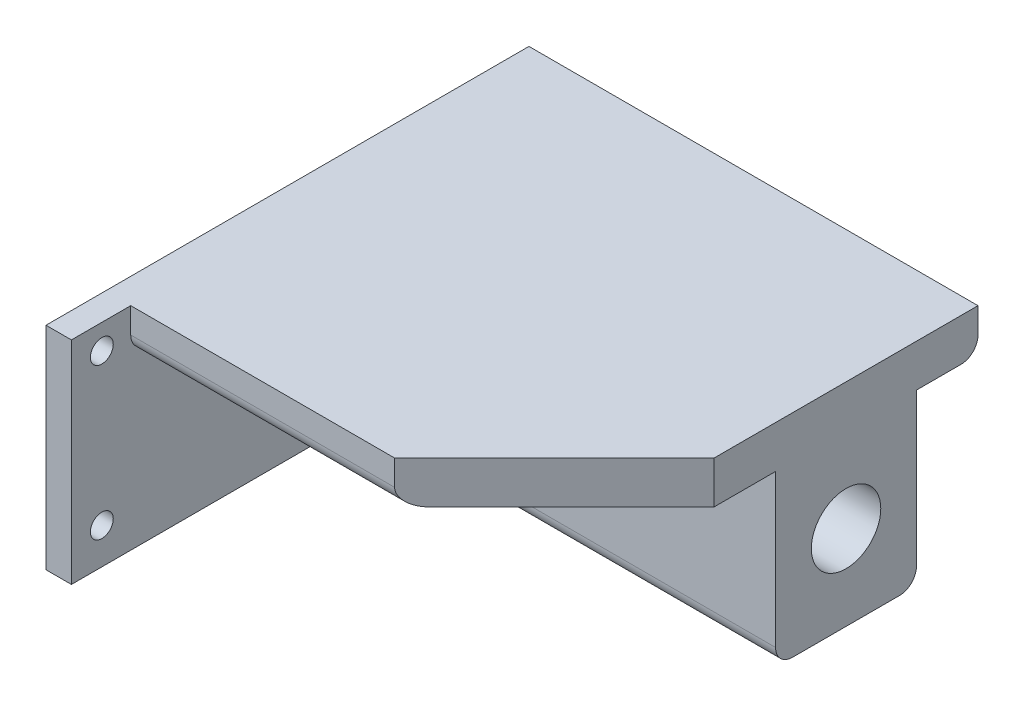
ISO-10303-21;
HEADER;
FILE_DESCRIPTION(('STEP AP214'),'2;1');
FILE_NAME('part.step','',(''),(''),'','','');
FILE_SCHEMA(('AUTOMOTIVE_DESIGN { 1 0 10303 214 1 1 1 1 }'));
ENDSEC;
DATA;
#1=APPLICATION_CONTEXT('core data for automotive mechanical design processes');
#2=APPLICATION_PROTOCOL_DEFINITION('international standard','automotive_design',2000,#1);
#3=PRODUCT_CONTEXT('',#1,'mechanical');
#4=PRODUCT('Part','Part','',(#3));
#5=PRODUCT_RELATED_PRODUCT_CATEGORY('part','',(#4));
#6=PRODUCT_DEFINITION_FORMATION('','',#4);
#7=PRODUCT_DEFINITION_CONTEXT('part definition',#1,'design');
#8=PRODUCT_DEFINITION('design','',#6,#7);
#9=PRODUCT_DEFINITION_SHAPE('','',#8);
#10=(LENGTH_UNIT() NAMED_UNIT(*) SI_UNIT(.MILLI.,.METRE.));
#11=(NAMED_UNIT(*) PLANE_ANGLE_UNIT() SI_UNIT($,.RADIAN.));
#12=(NAMED_UNIT(*) SI_UNIT($,.STERADIAN.) SOLID_ANGLE_UNIT());
#13=UNCERTAINTY_MEASURE_WITH_UNIT(LENGTH_MEASURE(1.E-05),#10,'distance_accuracy_value','');
#14=(GEOMETRIC_REPRESENTATION_CONTEXT(3) GLOBAL_UNCERTAINTY_ASSIGNED_CONTEXT((#13)) GLOBAL_UNIT_ASSIGNED_CONTEXT((#10,
#11,#12)) REPRESENTATION_CONTEXT('',''));
#15=CARTESIAN_POINT('',(0.,0.,0.));
#16=DIRECTION('',(0.,0.,1.));
#17=DIRECTION('',(1.,0.,0.));
#18=AXIS2_PLACEMENT_3D('',#15,#16,#17);
#19=CARTESIAN_POINT('',(0.,0.,0.));
#20=DIRECTION('',(0.,-1.,0.));
#21=DIRECTION('',(0.,0.,-1.));
#22=AXIS2_PLACEMENT_3D('',#19,#20,#21);
#23=PLANE('',#22);
#24=DIRECTION('',(0.,0.,1.));
#25=VECTOR('',#24,1.);
#26=CARTESIAN_POINT('',(-25.6189946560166,0.,25.6189946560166));
#27=LINE('',#26,#25);
#28=CARTESIAN_POINT('',(-25.6189946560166,0.,-22.3810053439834));
#29=VERTEX_POINT('',#28);
#30=CARTESIAN_POINT('',(-25.6189946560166,0.,-17.1193251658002));
#31=VERTEX_POINT('',#30);
#32=EDGE_CURVE('E216',#29,#31,#27,.T.);
#33=ORIENTED_EDGE('',*,*,#32,.F.);
#34=DIRECTION('',(-1.,0.,0.));
#35=VECTOR('',#34,1.);
#36=CARTESIAN_POINT('',(24.3810053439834,0.,-22.3810053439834));
#37=LINE('',#36,#35);
#38=CARTESIAN_POINT('',(24.3810053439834,0.,-22.3810053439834));
#39=VERTEX_POINT('',#38);
#40=EDGE_CURVE('E238',#29,#39,#37,.F.);
#41=ORIENTED_EDGE('',*,*,#40,.T.);
#42=DIRECTION('',(0.,0.,-1.));
#43=VECTOR('',#42,1.);
#44=CARTESIAN_POINT('',(24.3810053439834,0.,6.76758151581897));
#45=LINE('',#44,#43);
#46=CARTESIAN_POINT('',(24.3810053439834,0.,-17.1193251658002));
#47=VERTEX_POINT('',#46);
#48=EDGE_CURVE('E200',#47,#39,#45,.T.);
#49=ORIENTED_EDGE('',*,*,#48,.F.);
#50=DIRECTION('',(1.,0.,0.));
#51=VECTOR('',#50,1.);
#52=CARTESIAN_POINT('',(-25.6189946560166,0.,-17.1193251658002));
#53=LINE('',#52,#51);
#54=EDGE_CURVE('E187',#31,#47,#53,.T.);
#55=ORIENTED_EDGE('',*,*,#54,.F.);
#56=EDGE_LOOP('',(#33,#41,#49,#55));
#57=FACE_BOUND('',#56,.T.);
#58=ADVANCED_FACE('F32',(#57),#23,.T.);
#59=CARTESIAN_POINT('',(24.3810053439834,5.,6.76758151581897));
#60=DIRECTION('',(-1.,0.,0.));
#61=DIRECTION('',(0.,0.,1.));
#62=AXIS2_PLACEMENT_3D('',#59,#60,#61);
#63=PLANE('',#62);
#64=CARTESIAN_POINT('',(24.3810053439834,-10.,-8.80671191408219));
#65=DIRECTION('',(1.,0.,0.));
#66=DIRECTION('',(0.,0.,-1.));
#67=AXIS2_PLACEMENT_3D('',#64,#65,#66);
#68=CIRCLE('',#67,4.1);
#69=CARTESIAN_POINT('',(24.3810053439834,-10.,-12.9067119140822));
#70=VERTEX_POINT('',#69);
#71=EDGE_CURVE('E171',#70,#70,#68,.T.);
#72=ORIENTED_EDGE('',*,*,#71,.F.);
#73=EDGE_LOOP('',(#72));
#74=FACE_BOUND('',#73,.T.);
#75=ORIENTED_EDGE('',*,*,#48,.T.);
#76=CARTESIAN_POINT('',(24.3810053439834,2.,-22.3810053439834));
#77=DIRECTION('',(-1.,0.,0.));
#78=DIRECTION('',(0.,0.,1.));
#79=AXIS2_PLACEMENT_3D('',#76,#77,#78);
#80=CIRCLE('',#79,2.);
#81=CARTESIAN_POINT('',(24.3810053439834,2.,-24.3810053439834));
#82=VERTEX_POINT('',#81);
#83=EDGE_CURVE('E244',#39,#82,#80,.F.);
#84=ORIENTED_EDGE('',*,*,#83,.T.);
#85=DIRECTION('',(0.,-1.,0.));
#86=VECTOR('',#85,1.);
#87=CARTESIAN_POINT('',(24.3810053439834,5.,-24.3810053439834));
#88=LINE('',#87,#86);
#89=CARTESIAN_POINT('',(24.3810053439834,5.,-24.3810053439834));
#90=VERTEX_POINT('',#89);
#91=EDGE_CURVE('E226',#90,#82,#88,.T.);
#92=ORIENTED_EDGE('',*,*,#91,.F.);
#93=DIRECTION('',(0.,0.,-1.));
#94=VECTOR('',#93,1.);
#95=CARTESIAN_POINT('',(24.3810053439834,5.,6.76758151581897));
#96=LINE('',#95,#94);
#97=CARTESIAN_POINT('',(24.3810053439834,5.,6.76758151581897));
#98=VERTEX_POINT('',#97);
#99=EDGE_CURVE('E201',#98,#90,#96,.T.);
#100=ORIENTED_EDGE('',*,*,#99,.F.);
#101=DIRECTION('',(0.,-1.,0.));
#102=VECTOR('',#101,1.);
#103=CARTESIAN_POINT('',(24.3810053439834,5.,6.76758151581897));
#104=LINE('',#103,#102);
#105=CARTESIAN_POINT('',(24.3810053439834,0.,6.76758151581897));
#106=VERTEX_POINT('',#105);
#107=EDGE_CURVE('E211',#98,#106,#104,.T.);
#108=ORIENTED_EDGE('',*,*,#107,.T.);
#109=CARTESIAN_POINT('',(24.3810053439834,0.,-0.494098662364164));
#110=VERTEX_POINT('',#109);
#111=EDGE_CURVE('E212',#106,#110,#45,.T.);
#112=ORIENTED_EDGE('',*,*,#111,.T.);
#113=DIRECTION('',(0.,1.,0.));
#114=VECTOR('',#113,1.);
#115=CARTESIAN_POINT('',(24.3810053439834,-20.,-0.494098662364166));
#116=LINE('',#115,#114);
#117=CARTESIAN_POINT('',(24.3810053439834,-18.,-0.494098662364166));
#118=VERTEX_POINT('',#117);
#119=EDGE_CURVE('E198',#118,#110,#116,.T.);
#120=ORIENTED_EDGE('',*,*,#119,.F.);
#121=CARTESIAN_POINT('',(24.3810053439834,-18.,-2.49409866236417));
#122=DIRECTION('',(-1.,0.,0.));
#123=DIRECTION('',(0.,0.,1.));
#124=AXIS2_PLACEMENT_3D('',#121,#122,#123);
#125=CIRCLE('',#124,2.);
#126=CARTESIAN_POINT('',(24.3810053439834,-20.,-2.49409866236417));
#127=VERTEX_POINT('',#126);
#128=EDGE_CURVE('E240',#118,#127,#125,.F.);
#129=ORIENTED_EDGE('',*,*,#128,.T.);
#130=DIRECTION('',(0.,0.,1.));
#131=VECTOR('',#130,1.);
#132=CARTESIAN_POINT('',(24.3810053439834,-20.,-0.494098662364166));
#133=LINE('',#132,#131);
#134=CARTESIAN_POINT('',(24.3810053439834,-20.,-15.1193251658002));
#135=VERTEX_POINT('',#134);
#136=EDGE_CURVE('E183',#135,#127,#133,.T.);
#137=ORIENTED_EDGE('',*,*,#136,.F.);
#138=CARTESIAN_POINT('',(24.3810053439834,-18.,-15.1193251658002));
#139=DIRECTION('',(-1.,0.,0.));
#140=DIRECTION('',(0.,0.,1.));
#141=AXIS2_PLACEMENT_3D('',#138,#139,#140);
#142=CIRCLE('',#141,2.);
#143=CARTESIAN_POINT('',(24.3810053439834,-18.,-17.1193251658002));
#144=VERTEX_POINT('',#143);
#145=EDGE_CURVE('E242',#135,#144,#142,.F.);
#146=ORIENTED_EDGE('',*,*,#145,.T.);
#147=DIRECTION('',(0.,1.,0.));
#148=VECTOR('',#147,1.);
#149=CARTESIAN_POINT('',(24.3810053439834,-20.,-17.1193251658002));
#150=LINE('',#149,#148);
#151=EDGE_CURVE('E186',#144,#47,#150,.T.);
#152=ORIENTED_EDGE('',*,*,#151,.T.);
#153=EDGE_LOOP('',(#75,#84,#92,#100,#108,#112,#120,#129,#137,#146,#152));
#154=FACE_BOUND('',#153,.T.);
#155=ADVANCED_FACE('F339',(#74,#154),#63,.F.);
#156=CARTESIAN_POINT('',(-25.6189946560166,5.,-24.3810053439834));
#157=DIRECTION('',(0.,0.,1.));
#158=DIRECTION('',(1.,0.,0.));
#159=AXIS2_PLACEMENT_3D('',#156,#157,#158);
#160=PLANE('',#159);
#161=ORIENTED_EDGE('',*,*,#91,.T.);
#162=DIRECTION('',(-1.,0.,0.));
#163=VECTOR('',#162,1.);
#164=CARTESIAN_POINT('',(-25.6189946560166,2.,-24.3810053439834));
#165=LINE('',#164,#163);
#166=CARTESIAN_POINT('',(-25.6189946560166,2.,-24.3810053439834));
#167=VERTEX_POINT('',#166);
#168=EDGE_CURVE('E228',#82,#167,#165,.T.);
#169=ORIENTED_EDGE('',*,*,#168,.T.);
#170=DIRECTION('',(0.,-1.,0.));
#171=VECTOR('',#170,1.);
#172=CARTESIAN_POINT('',(-25.6189946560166,5.,-24.3810053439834));
#173=LINE('',#172,#171);
#174=CARTESIAN_POINT('',(-25.6189946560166,-20.,-24.3810053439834));
#175=VERTEX_POINT('',#174);
#176=EDGE_CURVE('E169',#167,#175,#173,.T.);
#177=ORIENTED_EDGE('',*,*,#176,.T.);
#178=DIRECTION('',(1.,0.,0.));
#179=VECTOR('',#178,1.);
#180=CARTESIAN_POINT('',(-28.6189946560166,-20.,-24.3810053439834));
#181=LINE('',#180,#179);
#182=CARTESIAN_POINT('',(-28.6189946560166,-20.,-24.3810053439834));
#183=VERTEX_POINT('',#182);
#184=EDGE_CURVE('E150',#183,#175,#181,.T.);
#185=ORIENTED_EDGE('',*,*,#184,.F.);
#186=DIRECTION('',(0.,-1.,0.));
#187=VECTOR('',#186,1.);
#188=CARTESIAN_POINT('',(-28.6189946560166,5.,-24.3810053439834));
#189=LINE('',#188,#187);
#190=CARTESIAN_POINT('',(-28.6189946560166,5.,-24.3810053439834));
#191=VERTEX_POINT('',#190);
#192=EDGE_CURVE('E156',#191,#183,#189,.T.);
#193=ORIENTED_EDGE('',*,*,#192,.F.);
#194=DIRECTION('',(-1.,0.,0.));
#195=VECTOR('',#194,1.);
#196=CARTESIAN_POINT('',(-25.6189946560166,5.,-24.3810053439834));
#197=LINE('',#196,#195);
#198=EDGE_CURVE('E204',#90,#191,#197,.T.);
#199=ORIENTED_EDGE('',*,*,#198,.F.);
#200=EDGE_LOOP('',(#161,#169,#177,#185,#193,#199));
#201=FACE_BOUND('',#200,.T.);
#202=ADVANCED_FACE('F167',(#201),#160,.F.);
#203=CARTESIAN_POINT('',(-25.6189946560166,5.,25.6189946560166));
#204=DIRECTION('',(0.,0.,-1.));
#205=DIRECTION('',(-1.,0.,0.));
#206=AXIS2_PLACEMENT_3D('',#203,#204,#205);
#207=PLANE('',#206);
#208=DIRECTION('',(0.,-1.,0.));
#209=VECTOR('',#208,1.);
#210=CARTESIAN_POINT('',(-25.6189946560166,5.,25.6189946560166));
#211=LINE('',#210,#209);
#212=CARTESIAN_POINT('',(-25.6189946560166,5.,25.6189946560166));
#213=VERTEX_POINT('',#212);
#214=CARTESIAN_POINT('',(-25.6189946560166,2.,25.6189946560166));
#215=VERTEX_POINT('',#214);
#216=EDGE_CURVE('E223',#213,#215,#211,.T.);
#217=ORIENTED_EDGE('',*,*,#216,.T.);
#218=DIRECTION('',(1.,0.,0.));
#219=VECTOR('',#218,1.);
#220=CARTESIAN_POINT('',(5.52959220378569,2.,25.6189946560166));
#221=LINE('',#220,#219);
#222=CARTESIAN_POINT('',(5.52959220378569,2.,25.6189946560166));
#223=VERTEX_POINT('',#222);
#224=EDGE_CURVE('E246',#215,#223,#221,.T.);
#225=ORIENTED_EDGE('',*,*,#224,.T.);
#226=DIRECTION('',(0.,-1.,0.));
#227=VECTOR('',#226,1.);
#228=CARTESIAN_POINT('',(5.52959220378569,5.,25.6189946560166));
#229=LINE('',#228,#227);
#230=CARTESIAN_POINT('',(5.52959220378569,5.,25.6189946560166));
#231=VERTEX_POINT('',#230);
#232=EDGE_CURVE('E221',#231,#223,#229,.T.);
#233=ORIENTED_EDGE('',*,*,#232,.F.);
#234=DIRECTION('',(1.,0.,0.));
#235=VECTOR('',#234,1.);
#236=CARTESIAN_POINT('',(-25.6189946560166,5.,25.6189946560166));
#237=LINE('',#236,#235);
#238=EDGE_CURVE('E207',#213,#231,#237,.T.);
#239=ORIENTED_EDGE('',*,*,#238,.F.);
#240=EDGE_LOOP('',(#217,#225,#233,#239));
#241=FACE_BOUND('',#240,.T.);
#242=ADVANCED_FACE('F371',(#241),#207,.F.);
#243=CARTESIAN_POINT('',(5.52959220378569,5.,25.6189946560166));
#244=DIRECTION('',(-0.707106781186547,0.,-0.707106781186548));
#245=DIRECTION('',(-0.707106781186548,0.,0.707106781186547));
#246=AXIS2_PLACEMENT_3D('',#243,#244,#245);
#247=PLANE('',#246);
#248=ORIENTED_EDGE('',*,*,#232,.T.);
#249=CARTESIAN_POINT('',(7.52959220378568,2.,23.6189946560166));
#250=DIRECTION('',(-0.707106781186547,0.,-0.707106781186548));
#251=DIRECTION('',(-0.707106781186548,0.,0.707106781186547));
#252=AXIS2_PLACEMENT_3D('',#249,#250,#251);
#253=ELLIPSE('',#252,2.82842712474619,2.);
#254=CARTESIAN_POINT('',(7.52959220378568,0.,23.6189946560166));
#255=VERTEX_POINT('',#254);
#256=EDGE_CURVE('E47',#223,#255,#253,.F.);
#257=ORIENTED_EDGE('',*,*,#256,.T.);
#258=DIRECTION('',(0.707106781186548,0.,-0.707106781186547));
#259=VECTOR('',#258,1.);
#260=CARTESIAN_POINT('',(5.52959220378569,0.,25.6189946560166));
#261=LINE('',#260,#259);
#262=EDGE_CURVE('E205',#255,#106,#261,.T.);
#263=ORIENTED_EDGE('',*,*,#262,.T.);
#264=ORIENTED_EDGE('',*,*,#107,.F.);
#265=DIRECTION('',(0.707106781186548,0.,-0.707106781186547));
#266=VECTOR('',#265,1.);
#267=CARTESIAN_POINT('',(5.52959220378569,5.,25.6189946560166));
#268=LINE('',#267,#266);
#269=EDGE_CURVE('E209',#231,#98,#268,.T.);
#270=ORIENTED_EDGE('',*,*,#269,.F.);
#271=EDGE_LOOP('',(#248,#257,#263,#264,#270));
#272=FACE_BOUND('',#271,.T.);
#273=ADVANCED_FACE('F361',(#272),#247,.F.);
#274=CARTESIAN_POINT('',(0.,5.,0.));
#275=DIRECTION('',(0.,-1.,0.));
#276=DIRECTION('',(0.,0.,-1.));
#277=AXIS2_PLACEMENT_3D('',#274,#275,#276);
#278=PLANE('',#277);
#279=ORIENTED_EDGE('',*,*,#99,.T.);
#280=ORIENTED_EDGE('',*,*,#198,.T.);
#281=DIRECTION('',(0.,0.,-1.));
#282=VECTOR('',#281,1.);
#283=CARTESIAN_POINT('',(-28.6189946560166,5.,-24.3810053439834));
#284=LINE('',#283,#282);
#285=CARTESIAN_POINT('',(-28.6189946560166,5.,32.6189946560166));
#286=VERTEX_POINT('',#285);
#287=EDGE_CURVE('E162',#286,#191,#284,.T.);
#288=ORIENTED_EDGE('',*,*,#287,.F.);
#289=DIRECTION('',(1.,0.,0.));
#290=VECTOR('',#289,1.);
#291=CARTESIAN_POINT('',(-28.6189946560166,5.,32.6189946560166));
#292=LINE('',#291,#290);
#293=CARTESIAN_POINT('',(-25.6189946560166,5.,32.6189946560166));
#294=VERTEX_POINT('',#293);
#295=EDGE_CURVE('E176',#286,#294,#292,.T.);
#296=ORIENTED_EDGE('',*,*,#295,.T.);
#297=DIRECTION('',(0.,0.,-1.));
#298=VECTOR('',#297,1.);
#299=CARTESIAN_POINT('',(-25.6189946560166,5.,-24.3810053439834));
#300=LINE('',#299,#298);
#301=EDGE_CURVE('E164',#294,#213,#300,.T.);
#302=ORIENTED_EDGE('',*,*,#301,.T.);
#303=ORIENTED_EDGE('',*,*,#238,.T.);
#304=ORIENTED_EDGE('',*,*,#269,.T.);
#305=EDGE_LOOP('',(#279,#280,#288,#296,#302,#303,#304));
#306=FACE_BOUND('',#305,.T.);
#307=ADVANCED_FACE('F353',(#306),#278,.F.);
#308=ORIENTED_EDGE('',*,*,#262,.F.);
#309=DIRECTION('',(1.,0.,0.));
#310=VECTOR('',#309,1.);
#311=CARTESIAN_POINT('',(-25.6189946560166,0.,23.6189946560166));
#312=LINE('',#311,#310);
#313=CARTESIAN_POINT('',(-25.6189946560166,0.,23.6189946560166));
#314=VERTEX_POINT('',#313);
#315=EDGE_CURVE('E249',#255,#314,#312,.F.);
#316=ORIENTED_EDGE('',*,*,#315,.T.);
#317=CARTESIAN_POINT('',(-25.6189946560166,0.,-0.494098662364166));
#318=VERTEX_POINT('',#317);
#319=EDGE_CURVE('E215',#318,#314,#27,.T.);
#320=ORIENTED_EDGE('',*,*,#319,.F.);
#321=DIRECTION('',(-1.,0.,0.));
#322=VECTOR('',#321,1.);
#323=CARTESIAN_POINT('',(-25.6189946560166,0.,-0.494098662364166));
#324=LINE('',#323,#322);
#325=EDGE_CURVE('E181',#110,#318,#324,.T.);
#326=ORIENTED_EDGE('',*,*,#325,.F.);
#327=ORIENTED_EDGE('',*,*,#111,.F.);
#328=EDGE_LOOP('',(#308,#316,#320,#326,#327));
#329=FACE_BOUND('',#328,.T.);
#330=ADVANCED_FACE('F342',(#329),#23,.T.);
#331=CARTESIAN_POINT('',(-25.6189946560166,-20.,-0.494098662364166));
#332=DIRECTION('',(0.,0.,-1.));
#333=DIRECTION('',(-1.,0.,0.));
#334=AXIS2_PLACEMENT_3D('',#331,#332,#333);
#335=PLANE('',#334);
#336=DIRECTION('',(0.,1.,0.));
#337=VECTOR('',#336,1.);
#338=CARTESIAN_POINT('',(-25.6189946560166,-20.,-0.494098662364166));
#339=LINE('',#338,#337);
#340=CARTESIAN_POINT('',(-25.6189946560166,-18.,-0.494098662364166));
#341=VERTEX_POINT('',#340);
#342=EDGE_CURVE('E196',#341,#318,#339,.T.);
#343=ORIENTED_EDGE('',*,*,#342,.F.);
#344=DIRECTION('',(-1.,0.,0.));
#345=VECTOR('',#344,1.);
#346=CARTESIAN_POINT('',(24.3810053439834,-18.,-0.494098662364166));
#347=LINE('',#346,#345);
#348=EDGE_CURVE('E11',#341,#118,#347,.F.);
#349=ORIENTED_EDGE('',*,*,#348,.T.);
#350=ORIENTED_EDGE('',*,*,#119,.T.);
#351=ORIENTED_EDGE('',*,*,#325,.T.);
#352=EDGE_LOOP('',(#343,#349,#350,#351));
#353=FACE_BOUND('',#352,.T.);
#354=ADVANCED_FACE('F352',(#353),#335,.F.);
#355=CARTESIAN_POINT('',(-25.6189946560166,-20.,-17.1193251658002));
#356=DIRECTION('',(0.,0.,1.));
#357=DIRECTION('',(1.,0.,0.));
#358=AXIS2_PLACEMENT_3D('',#355,#356,#357);
#359=PLANE('',#358);
#360=ORIENTED_EDGE('',*,*,#151,.F.);
#361=DIRECTION('',(1.,0.,0.));
#362=VECTOR('',#361,1.);
#363=CARTESIAN_POINT('',(-25.6189946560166,-18.,-17.1193251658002));
#364=LINE('',#363,#362);
#365=CARTESIAN_POINT('',(-25.6189946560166,-18.,-17.1193251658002));
#366=VERTEX_POINT('',#365);
#367=EDGE_CURVE('E40',#144,#366,#364,.F.);
#368=ORIENTED_EDGE('',*,*,#367,.T.);
#369=DIRECTION('',(0.,1.,0.));
#370=VECTOR('',#369,1.);
#371=CARTESIAN_POINT('',(-25.6189946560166,-20.,-17.1193251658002));
#372=LINE('',#371,#370);
#373=EDGE_CURVE('E193',#366,#31,#372,.T.);
#374=ORIENTED_EDGE('',*,*,#373,.T.);
#375=ORIENTED_EDGE('',*,*,#54,.T.);
#376=EDGE_LOOP('',(#360,#368,#374,#375));
#377=FACE_BOUND('',#376,.T.);
#378=ADVANCED_FACE('F261',(#377),#359,.F.);
#379=CARTESIAN_POINT('',(0.,-20.,0.));
#380=DIRECTION('',(0.,-1.,0.));
#381=DIRECTION('',(0.,0.,-1.));
#382=AXIS2_PLACEMENT_3D('',#379,#380,#381);
#383=PLANE('',#382);
#384=DIRECTION('',(-1.,0.,0.));
#385=VECTOR('',#384,1.);
#386=CARTESIAN_POINT('',(-25.6189946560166,-20.,-2.49409866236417));
#387=LINE('',#386,#385);
#388=CARTESIAN_POINT('',(-25.6189946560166,-20.,-2.49409866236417));
#389=VERTEX_POINT('',#388);
#390=EDGE_CURVE('E252',#127,#389,#387,.T.);
#391=ORIENTED_EDGE('',*,*,#390,.T.);
#392=DIRECTION('',(0.,0.,1.));
#393=VECTOR('',#392,1.);
#394=CARTESIAN_POINT('',(-25.6189946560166,-20.,-24.3810053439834));
#395=LINE('',#394,#393);
#396=CARTESIAN_POINT('',(-25.6189946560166,-20.,32.6189946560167));
#397=VERTEX_POINT('',#396);
#398=EDGE_CURVE('E271',#389,#397,#395,.T.);
#399=ORIENTED_EDGE('',*,*,#398,.T.);
#400=DIRECTION('',(1.,0.,0.));
#401=VECTOR('',#400,1.);
#402=CARTESIAN_POINT('',(-28.6189946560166,-20.,32.6189946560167));
#403=LINE('',#402,#401);
#404=CARTESIAN_POINT('',(-28.6189946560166,-20.,32.6189946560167));
#405=VERTEX_POINT('',#404);
#406=EDGE_CURVE('E152',#405,#397,#403,.T.);
#407=ORIENTED_EDGE('',*,*,#406,.F.);
#408=DIRECTION('',(0.,0.,1.));
#409=VECTOR('',#408,1.);
#410=CARTESIAN_POINT('',(-28.6189946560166,-20.,-24.3810053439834));
#411=LINE('',#410,#409);
#412=EDGE_CURVE('E144',#183,#405,#411,.T.);
#413=ORIENTED_EDGE('',*,*,#412,.F.);
#414=ORIENTED_EDGE('',*,*,#184,.T.);
#415=CARTESIAN_POINT('',(-25.6189946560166,-20.,-15.1193251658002));
#416=VERTEX_POINT('',#415);
#417=EDGE_CURVE('E268',#175,#416,#395,.T.);
#418=ORIENTED_EDGE('',*,*,#417,.T.);
#419=DIRECTION('',(1.,0.,0.));
#420=VECTOR('',#419,1.);
#421=CARTESIAN_POINT('',(24.3810053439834,-20.,-15.1193251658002));
#422=LINE('',#421,#420);
#423=EDGE_CURVE('E254',#416,#135,#422,.T.);
#424=ORIENTED_EDGE('',*,*,#423,.T.);
#425=ORIENTED_EDGE('',*,*,#136,.T.);
#426=EDGE_LOOP('',(#391,#399,#407,#413,#414,#418,#424,#425));
#427=FACE_BOUND('',#426,.T.);
#428=ADVANCED_FACE('F147',(#427),#383,.T.);
#429=CARTESIAN_POINT('',(-5.61899465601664,-10.,-8.80671191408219));
#430=DIRECTION('',(1.,0.,0.));
#431=DIRECTION('',(0.,0.,-1.));
#432=AXIS2_PLACEMENT_3D('',#429,#430,#431);
#433=CYLINDRICAL_SURFACE('',#432,4.1);
#434=CARTESIAN_POINT('',(-5.61899465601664,-10.,-8.80671191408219));
#435=DIRECTION('',(1.,0.,0.));
#436=DIRECTION('',(0.,0.,-1.));
#437=AXIS2_PLACEMENT_3D('',#434,#435,#436);
#438=CIRCLE('',#437,4.1);
#439=CARTESIAN_POINT('',(-5.61899465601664,-10.,-12.9067119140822));
#440=VERTEX_POINT('',#439);
#441=EDGE_CURVE('E174',#440,#440,#438,.T.);
#442=ORIENTED_EDGE('',*,*,#441,.F.);
#443=EDGE_LOOP('',(#442));
#444=FACE_BOUND('',#443,.T.);
#445=ORIENTED_EDGE('',*,*,#71,.T.);
#446=EDGE_LOOP('',(#445));
#447=FACE_BOUND('',#446,.T.);
#448=ADVANCED_FACE('F483',(#444,#447),#433,.F.);
#449=CARTESIAN_POINT('',(-5.61899465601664,-10.,-8.80671191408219));
#450=DIRECTION('',(1.,0.,0.));
#451=DIRECTION('',(0.,0.,-1.));
#452=AXIS2_PLACEMENT_3D('',#449,#450,#451);
#453=PLANE('',#452);
#454=ORIENTED_EDGE('',*,*,#441,.T.);
#455=EDGE_LOOP('',(#454));
#456=FACE_BOUND('',#455,.T.);
#457=ADVANCED_FACE('F404',(#456),#453,.T.);
#458=CARTESIAN_POINT('',(-25.6189946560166,2.,-22.3810053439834));
#459=DIRECTION('',(1.,0.,0.));
#460=DIRECTION('',(0.,0.,-1.));
#461=AXIS2_PLACEMENT_3D('',#458,#459,#460);
#462=CYLINDRICAL_SURFACE('',#461,2.);
#463=ORIENTED_EDGE('',*,*,#83,.F.);
#464=ORIENTED_EDGE('',*,*,#40,.F.);
#465=CARTESIAN_POINT('',(-25.6189946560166,2.,-22.3810053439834));
#466=DIRECTION('',(1.,0.,0.));
#467=DIRECTION('',(0.,0.,-1.));
#468=AXIS2_PLACEMENT_3D('',#465,#466,#467);
#469=CIRCLE('',#468,2.);
#470=EDGE_CURVE('E236',#167,#29,#469,.F.);
#471=ORIENTED_EDGE('',*,*,#470,.F.);
#472=ORIENTED_EDGE('',*,*,#168,.F.);
#473=EDGE_LOOP('',(#463,#464,#471,#472));
#474=FACE_BOUND('',#473,.T.);
#475=ADVANCED_FACE('F384',(#474),#462,.T.);
#476=CARTESIAN_POINT('',(-25.6189946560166,2.,23.6189946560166));
#477=DIRECTION('',(-1.,0.,0.));
#478=DIRECTION('',(0.,0.,1.));
#479=AXIS2_PLACEMENT_3D('',#476,#477,#478);
#480=CYLINDRICAL_SURFACE('',#479,2.);
#481=CARTESIAN_POINT('',(-25.6189946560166,2.,23.6189946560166));
#482=DIRECTION('',(1.,0.,0.));
#483=DIRECTION('',(0.,0.,-1.));
#484=AXIS2_PLACEMENT_3D('',#481,#482,#483);
#485=CIRCLE('',#484,2.);
#486=EDGE_CURVE('E234',#314,#215,#485,.F.);
#487=ORIENTED_EDGE('',*,*,#486,.F.);
#488=ORIENTED_EDGE('',*,*,#315,.F.);
#489=ORIENTED_EDGE('',*,*,#256,.F.);
#490=ORIENTED_EDGE('',*,*,#224,.F.);
#491=EDGE_LOOP('',(#487,#488,#489,#490));
#492=FACE_BOUND('',#491,.T.);
#493=ADVANCED_FACE('F367',(#492),#480,.T.);
#494=CARTESIAN_POINT('',(0.,-18.,-15.1193251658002));
#495=DIRECTION('',(-1.,0.,0.));
#496=DIRECTION('',(0.,0.,1.));
#497=AXIS2_PLACEMENT_3D('',#494,#495,#496);
#498=CYLINDRICAL_SURFACE('',#497,2.);
#499=CARTESIAN_POINT('',(-25.6189946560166,-18.,-15.1193251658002));
#500=DIRECTION('',(1.,0.,0.));
#501=DIRECTION('',(0.,0.,-1.));
#502=AXIS2_PLACEMENT_3D('',#499,#500,#501);
#503=CIRCLE('',#502,2.);
#504=EDGE_CURVE('E232',#366,#416,#503,.F.);
#505=ORIENTED_EDGE('',*,*,#504,.F.);
#506=ORIENTED_EDGE('',*,*,#367,.F.);
#507=ORIENTED_EDGE('',*,*,#145,.F.);
#508=ORIENTED_EDGE('',*,*,#423,.F.);
#509=EDGE_LOOP('',(#505,#506,#507,#508));
#510=FACE_BOUND('',#509,.T.);
#511=ADVANCED_FACE('F265',(#510),#498,.T.);
#512=CARTESIAN_POINT('',(0.,-18.,-2.49409866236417));
#513=DIRECTION('',(1.,0.,0.));
#514=DIRECTION('',(0.,0.,-1.));
#515=AXIS2_PLACEMENT_3D('',#512,#513,#514);
#516=CYLINDRICAL_SURFACE('',#515,2.);
#517=ORIENTED_EDGE('',*,*,#128,.F.);
#518=ORIENTED_EDGE('',*,*,#348,.F.);
#519=CARTESIAN_POINT('',(-25.6189946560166,-18.,-2.49409866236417));
#520=DIRECTION('',(1.,0.,0.));
#521=DIRECTION('',(0.,0.,-1.));
#522=AXIS2_PLACEMENT_3D('',#519,#520,#521);
#523=CIRCLE('',#522,2.);
#524=EDGE_CURVE('E230',#389,#341,#523,.F.);
#525=ORIENTED_EDGE('',*,*,#524,.F.);
#526=ORIENTED_EDGE('',*,*,#390,.F.);
#527=EDGE_LOOP('',(#517,#518,#525,#526));
#528=FACE_BOUND('',#527,.T.);
#529=ADVANCED_FACE('F34',(#528),#516,.T.);
#530=CARTESIAN_POINT('',(-25.6189946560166,0.,0.));
#531=DIRECTION('',(-1.,0.,0.));
#532=DIRECTION('',(0.,0.,1.));
#533=AXIS2_PLACEMENT_3D('',#530,#531,#532);
#534=PLANE('',#533);
#535=CARTESIAN_POINT('',(-25.6189946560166,-15.7498007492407,-21.1167764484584));
#536=DIRECTION('',(-1.,0.,0.));
#537=DIRECTION('',(0.,0.,1.));
#538=AXIS2_PLACEMENT_3D('',#535,#536,#537);
#539=CIRCLE('',#538,1.35);
#540=CARTESIAN_POINT('',(-25.6189946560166,-15.7498007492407,-19.7667764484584));
#541=VERTEX_POINT('',#540);
#542=EDGE_CURVE('E290',#541,#541,#539,.T.);
#543=ORIENTED_EDGE('',*,*,#542,.T.);
#544=EDGE_LOOP('',(#543));
#545=FACE_BOUND('',#544,.T.);
#546=CARTESIAN_POINT('',(-25.6189946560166,-3.149002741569,-21.1167764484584));
#547=DIRECTION('',(-1.,0.,0.));
#548=DIRECTION('',(0.,0.,1.));
#549=AXIS2_PLACEMENT_3D('',#546,#547,#548);
#550=CIRCLE('',#549,1.35);
#551=CARTESIAN_POINT('',(-25.6189946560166,-3.149002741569,-19.7667764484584));
#552=VERTEX_POINT('',#551);
#553=EDGE_CURVE('E284',#552,#552,#550,.T.);
#554=ORIENTED_EDGE('',*,*,#553,.T.);
#555=EDGE_LOOP('',(#554));
#556=FACE_BOUND('',#555,.T.);
#557=ORIENTED_EDGE('',*,*,#176,.F.);
#558=ORIENTED_EDGE('',*,*,#470,.T.);
#559=ORIENTED_EDGE('',*,*,#32,.T.);
#560=ORIENTED_EDGE('',*,*,#373,.F.);
#561=ORIENTED_EDGE('',*,*,#504,.T.);
#562=ORIENTED_EDGE('',*,*,#417,.F.);
#563=EDGE_LOOP('',(#557,#558,#559,#560,#561,#562));
#564=FACE_BOUND('',#563,.T.);
#565=ADVANCED_FACE('F267',(#545,#556,#564),#534,.F.);
#566=CARTESIAN_POINT('',(-25.6189946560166,-15.7498007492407,29.0298516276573));
#567=DIRECTION('',(-1.,0.,0.));
#568=DIRECTION('',(0.,0.,1.));
#569=AXIS2_PLACEMENT_3D('',#566,#567,#568);
#570=CIRCLE('',#569,1.35);
#571=CARTESIAN_POINT('',(-25.6189946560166,-15.7498007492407,30.3798516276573));
#572=VERTEX_POINT('',#571);
#573=EDGE_CURVE('E293',#572,#572,#570,.T.);
#574=ORIENTED_EDGE('',*,*,#573,.T.);
#575=EDGE_LOOP('',(#574));
#576=FACE_BOUND('',#575,.T.);
#577=CARTESIAN_POINT('',(-25.6189946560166,2.09174198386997,29.0298516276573));
#578=DIRECTION('',(-1.,0.,0.));
#579=DIRECTION('',(0.,0.,1.));
#580=AXIS2_PLACEMENT_3D('',#577,#578,#579);
#581=CIRCLE('',#580,1.35);
#582=CARTESIAN_POINT('',(-25.6189946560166,2.09174198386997,30.3798516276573));
#583=VERTEX_POINT('',#582);
#584=EDGE_CURVE('E296',#583,#583,#581,.T.);
#585=ORIENTED_EDGE('',*,*,#584,.T.);
#586=EDGE_LOOP('',(#585));
#587=FACE_BOUND('',#586,.T.);
#588=ORIENTED_EDGE('',*,*,#398,.F.);
#589=ORIENTED_EDGE('',*,*,#524,.T.);
#590=ORIENTED_EDGE('',*,*,#342,.T.);
#591=ORIENTED_EDGE('',*,*,#319,.T.);
#592=ORIENTED_EDGE('',*,*,#486,.T.);
#593=ORIENTED_EDGE('',*,*,#216,.F.);
#594=ORIENTED_EDGE('',*,*,#301,.F.);
#595=DIRECTION('',(0.,1.,0.));
#596=VECTOR('',#595,1.);
#597=CARTESIAN_POINT('',(-25.6189946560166,5.,32.6189946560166));
#598=LINE('',#597,#596);
#599=EDGE_CURVE('E270',#397,#294,#598,.T.);
#600=ORIENTED_EDGE('',*,*,#599,.F.);
#601=EDGE_LOOP('',(#588,#589,#590,#591,#592,#593,#594,#600));
#602=FACE_BOUND('',#601,.T.);
#603=ADVANCED_FACE('F320',(#576,#587,#602),#534,.F.);
#604=CARTESIAN_POINT('',(-28.6189946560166,5.,32.6189946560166));
#605=DIRECTION('',(0.,0.,-1.));
#606=DIRECTION('',(0.,1.,0.));
#607=AXIS2_PLACEMENT_3D('',#604,#605,#606);
#608=PLANE('',#607);
#609=ORIENTED_EDGE('',*,*,#599,.T.);
#610=ORIENTED_EDGE('',*,*,#295,.F.);
#611=DIRECTION('',(0.,1.,0.));
#612=VECTOR('',#611,1.);
#613=CARTESIAN_POINT('',(-28.6189946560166,5.,32.6189946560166));
#614=LINE('',#613,#612);
#615=EDGE_CURVE('E155',#405,#286,#614,.T.);
#616=ORIENTED_EDGE('',*,*,#615,.F.);
#617=ORIENTED_EDGE('',*,*,#406,.T.);
#618=EDGE_LOOP('',(#609,#610,#616,#617));
#619=FACE_BOUND('',#618,.T.);
#620=ADVANCED_FACE('F335',(#619),#608,.F.);
#621=CARTESIAN_POINT('',(-28.6189946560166,0.,0.));
#622=DIRECTION('',(-1.,0.,0.));
#623=DIRECTION('',(0.,0.,1.));
#624=AXIS2_PLACEMENT_3D('',#621,#622,#623);
#625=PLANE('',#624);
#626=CARTESIAN_POINT('',(-28.6189946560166,-15.7498007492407,-21.1167764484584));
#627=DIRECTION('',(1.,0.,0.));
#628=DIRECTION('',(0.,0.,-1.));
#629=AXIS2_PLACEMENT_3D('',#626,#627,#628);
#630=CIRCLE('',#629,1.35);
#631=CARTESIAN_POINT('',(-28.6189946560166,-15.7498007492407,-22.4667764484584));
#632=VERTEX_POINT('',#631);
#633=EDGE_CURVE('E299',#632,#632,#630,.T.);
#634=ORIENTED_EDGE('',*,*,#633,.T.);
#635=EDGE_LOOP('',(#634));
#636=FACE_BOUND('',#635,.T.);
#637=CARTESIAN_POINT('',(-28.6189946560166,-15.7498007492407,29.0298516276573));
#638=DIRECTION('',(1.,0.,0.));
#639=DIRECTION('',(0.,0.,-1.));
#640=AXIS2_PLACEMENT_3D('',#637,#638,#639);
#641=CIRCLE('',#640,1.35);
#642=CARTESIAN_POINT('',(-28.6189946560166,-15.7498007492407,27.6798516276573));
#643=VERTEX_POINT('',#642);
#644=EDGE_CURVE('E303',#643,#643,#641,.T.);
#645=ORIENTED_EDGE('',*,*,#644,.T.);
#646=EDGE_LOOP('',(#645));
#647=FACE_BOUND('',#646,.T.);
#648=CARTESIAN_POINT('',(-28.6189946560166,2.09174198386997,29.0298516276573));
#649=DIRECTION('',(1.,0.,0.));
#650=DIRECTION('',(0.,0.,-1.));
#651=AXIS2_PLACEMENT_3D('',#648,#649,#650);
#652=CIRCLE('',#651,1.35);
#653=CARTESIAN_POINT('',(-28.6189946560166,2.09174198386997,27.6798516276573));
#654=VERTEX_POINT('',#653);
#655=EDGE_CURVE('E300',#654,#654,#652,.T.);
#656=ORIENTED_EDGE('',*,*,#655,.T.);
#657=EDGE_LOOP('',(#656));
#658=FACE_BOUND('',#657,.T.);
#659=CARTESIAN_POINT('',(-28.6189946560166,-3.149002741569,-21.1167764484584));
#660=DIRECTION('',(1.,0.,0.));
#661=DIRECTION('',(0.,0.,-1.));
#662=AXIS2_PLACEMENT_3D('',#659,#660,#661);
#663=CIRCLE('',#662,1.35);
#664=CARTESIAN_POINT('',(-28.6189946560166,-3.149002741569,-22.4667764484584));
#665=VERTEX_POINT('',#664);
#666=EDGE_CURVE('E287',#665,#665,#663,.T.);
#667=ORIENTED_EDGE('',*,*,#666,.T.);
#668=EDGE_LOOP('',(#667));
#669=FACE_BOUND('',#668,.T.);
#670=ORIENTED_EDGE('',*,*,#192,.T.);
#671=ORIENTED_EDGE('',*,*,#412,.T.);
#672=ORIENTED_EDGE('',*,*,#615,.T.);
#673=ORIENTED_EDGE('',*,*,#287,.T.);
#674=EDGE_LOOP('',(#670,#671,#672,#673));
#675=FACE_BOUND('',#674,.T.);
#676=ADVANCED_FACE('F160',(#636,#647,#658,#669,#675),#625,.T.);
#677=CARTESIAN_POINT('',(-28.6189946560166,-3.149002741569,-21.1167764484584));
#678=DIRECTION('',(1.,0.,0.));
#679=DIRECTION('',(0.,0.,-1.));
#680=AXIS2_PLACEMENT_3D('',#677,#678,#679);
#681=CYLINDRICAL_SURFACE('',#680,1.35);
#682=ORIENTED_EDGE('',*,*,#666,.F.);
#683=EDGE_LOOP('',(#682));
#684=FACE_BOUND('',#683,.T.);
#685=ORIENTED_EDGE('',*,*,#553,.F.);
#686=EDGE_LOOP('',(#685));
#687=FACE_BOUND('',#686,.T.);
#688=ADVANCED_FACE('F324',(#684,#687),#681,.F.);
#689=CARTESIAN_POINT('',(-28.6189946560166,2.09174198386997,29.0298516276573));
#690=DIRECTION('',(1.,0.,0.));
#691=DIRECTION('',(0.,0.,-1.));
#692=AXIS2_PLACEMENT_3D('',#689,#690,#691);
#693=CYLINDRICAL_SURFACE('',#692,1.35);
#694=ORIENTED_EDGE('',*,*,#655,.F.);
#695=EDGE_LOOP('',(#694));
#696=FACE_BOUND('',#695,.T.);
#697=ORIENTED_EDGE('',*,*,#584,.F.);
#698=EDGE_LOOP('',(#697));
#699=FACE_BOUND('',#698,.T.);
#700=ADVANCED_FACE('F326',(#696,#699),#693,.F.);
#701=CARTESIAN_POINT('',(-28.6189946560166,-15.7498007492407,29.0298516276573));
#702=DIRECTION('',(1.,0.,0.));
#703=DIRECTION('',(0.,0.,-1.));
#704=AXIS2_PLACEMENT_3D('',#701,#702,#703);
#705=CYLINDRICAL_SURFACE('',#704,1.35);
#706=ORIENTED_EDGE('',*,*,#644,.F.);
#707=EDGE_LOOP('',(#706));
#708=FACE_BOUND('',#707,.T.);
#709=ORIENTED_EDGE('',*,*,#573,.F.);
#710=EDGE_LOOP('',(#709));
#711=FACE_BOUND('',#710,.T.);
#712=ADVANCED_FACE('F314',(#708,#711),#705,.F.);
#713=CARTESIAN_POINT('',(-28.6189946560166,-15.7498007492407,-21.1167764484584));
#714=DIRECTION('',(1.,0.,0.));
#715=DIRECTION('',(0.,0.,-1.));
#716=AXIS2_PLACEMENT_3D('',#713,#714,#715);
#717=CYLINDRICAL_SURFACE('',#716,1.35);
#718=ORIENTED_EDGE('',*,*,#633,.F.);
#719=EDGE_LOOP('',(#718));
#720=FACE_BOUND('',#719,.T.);
#721=ORIENTED_EDGE('',*,*,#542,.F.);
#722=EDGE_LOOP('',(#721));
#723=FACE_BOUND('',#722,.T.);
#724=ADVANCED_FACE('F311',(#720,#723),#717,.F.);
#725=CLOSED_SHELL('',(#58,#155,#202,#242,#273,#307,#330,#354,#378,#428,#448,#457,#475,#493,#511,
#529,#565,#603,#620,#676,#688,#700,#712,#724));
#726=MANIFOLD_SOLID_BREP('B2',#725);
#727=ADVANCED_BREP_SHAPE_REPRESENTATION('',(#18,#726),#14);
#728=SHAPE_DEFINITION_REPRESENTATION(#9,#727);
ENDSEC;
END-ISO-10303-21;
